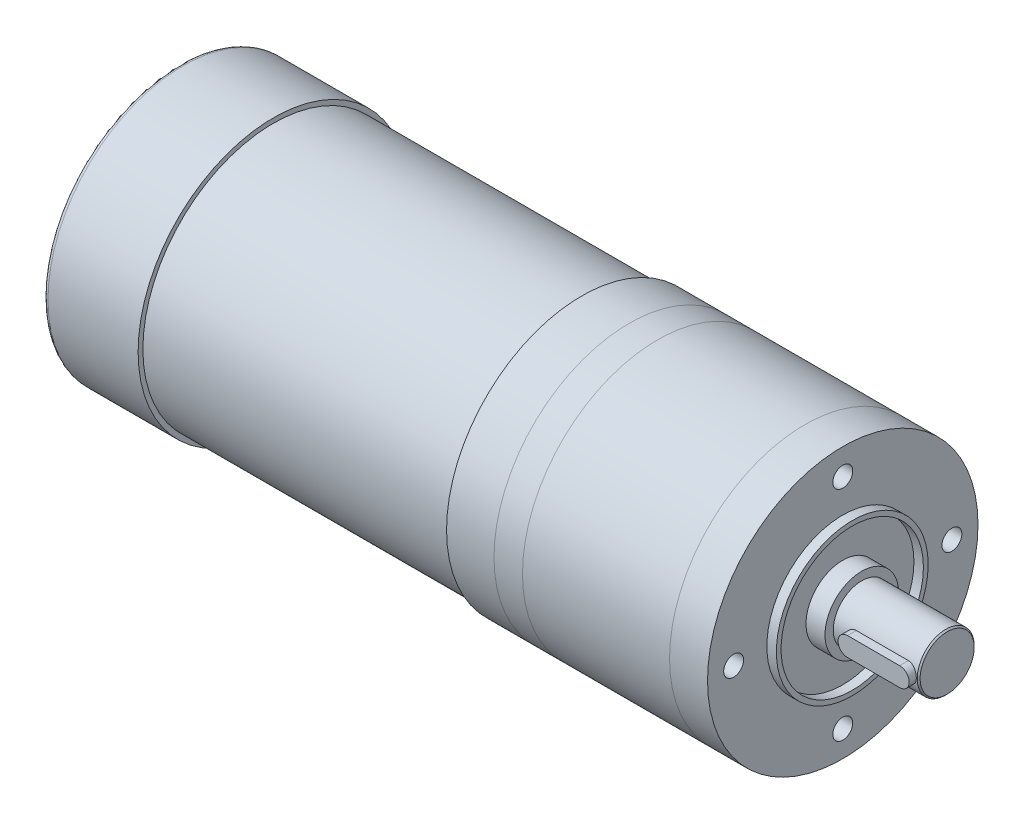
from build123d import *

# Parameters (mm, degrees)
SKETCH_1_R                  = 28.5
EXTRUDE_1_DEPTH             = 8
SKETCH_2_R                  = 28.5
EXTRUDE_2_DEPTH             = 31
SKETCH_3_R                  = 28.5
EXTRUDE_3_DEPTH             = 6
SKETCH_4_R                  = 28.5
EXTRUDE_4_DEPTH             = 10
SKETCH_5_R                  = 27.5
EXTRUDE_5_DEPTH             = 65
SKETCH_6_R                  = 28.5
EXTRUDE_6_DEPTH             = 20
FILLET_1_R                  = 1
SKETCH_7_R                  = 16
SKETCH_7_R_2                = 15
EXTRUDE_7_DEPTH             = 2
SKETCH_8_R                  = 7.75
EXTRUDE_8_DEPTH             = 4
SKETCH_9_R                  = 6
EXTRUDE_9_DEPTH             = 18
HOLE_WIZARD_M5_1_AT_2_COUNT = 2
HOLE_WIZARD_M5_1_AT_2_PITCH = 32.526911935
HOLE_WIZARD_M5_1_AT_3_COUNT = 2
HOLE_WIZARD_M5_1_AT_3_PITCH = 46
HOLE_WIZARD_M5_1_AT_4_COUNT = 2
HOLE_WIZARD_M5_1_AT_4_PITCH = 32.526911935
CUT_EXTRUDE_1_DEPTH         = 2.5
EXTRUDE_10_DEPTH            = 4
CHAMFER_1_SIZE              = 0.3


with BuildPart() as part:
    # Sketch 1 → Extrude 1 (new body)
    with BuildSketch(Plane(origin=(0, 0, 0), x_dir=(0, 0, -1), z_dir=(1, 0, 0))):
        Circle(SKETCH_1_R)
    extrude(amount=-EXTRUDE_1_DEPTH)

    # Sketch 7 → Extrude 7 (add)
    with BuildSketch(Plane(origin=(0, 0, 0), x_dir=(0, 0, -1), z_dir=(1, 0, 0))):
        Circle(SKETCH_7_R)
        Circle(SKETCH_7_R_2, mode=Mode.SUBTRACT)
    extrude(amount=EXTRUDE_7_DEPTH)

    # Sketch 8 → Extrude 8 (add)
    with BuildSketch(Plane(origin=(0, 0, 0), x_dir=(0, 0, -1), z_dir=(1, 0, 0))):
        Circle(SKETCH_8_R)
    extrude(amount=EXTRUDE_8_DEPTH)

    # Sketch 9 → Extrude 9 (add)
    with BuildSketch(Plane(origin=(4, 0, 0), x_dir=(0, 0, -1), z_dir=(1, 0, 0))):
        Circle(SKETCH_9_R)
    extrude(amount=EXTRUDE_9_DEPTH)


with BuildPart() as body_2:
    # Sketch 2 → Extrude 2 (new body)
    with BuildSketch(Plane.ZY.offset(8)):
        Circle(SKETCH_2_R)
    extrude(amount=EXTRUDE_2_DEPTH)


with BuildPart() as body_3:
    # Sketch 3 → Extrude 3 (new body)
    with BuildSketch(Plane.ZY.offset(39)):
        Circle(SKETCH_3_R)
    extrude(amount=EXTRUDE_3_DEPTH)


with BuildPart() as body_4:
    # Sketch 4 → Extrude 4 (new body)
    with BuildSketch(Plane.ZY.offset(45)):
        Circle(SKETCH_4_R)
    extrude(amount=EXTRUDE_4_DEPTH)

    # Sketch 5 → Extrude 5 (add)
    with BuildSketch(Plane.ZY.offset(55)):
        Circle(SKETCH_5_R)
    extrude(amount=EXTRUDE_5_DEPTH)

    # Sketch 6 → Extrude 6 (add)
    with BuildSketch(Plane.ZY.offset(120)):
        Circle(SKETCH_6_R)
    extrude(amount=EXTRUDE_6_DEPTH)

    # Fillet 1
    fillet_1_edges = [body_4.edges().sort_by_distance(p)[0] for p in [
        (-140, 0, -28.5),
    ]]
    fillet(fillet_1_edges, radius=FILLET_1_R)


with BuildPart() as hole_wizard_m5_1_tool:
    # Sketch 11 → Hole Wizard M5 _1 (revolve)
    with BuildSketch(Plane(origin=(0, 23, 0), x_dir=(0, 0, -1), z_dir=(0, 1, 0))):
        Polygon((0, 0), (0, 15.2618073), (2.1, 14), (2.1, 0), align=None)
    hole_wizard_m5_1 = revolve(axis=Axis((6.35, 23, 0), (-1, 0, 0)))


with BuildPart() as part_1:
    add(part.part)

    # Hole Wizard M5 _1: cut by hole_wizard_m5_1_tool
    add(hole_wizard_m5_1_tool.part, mode=Mode.SUBTRACT)


with BuildPart() as body_2_1:
    add(body_2.part)

    # Hole Wizard M5 _1: cut by hole_wizard_m5_1_tool
    add(hole_wizard_m5_1_tool.part, mode=Mode.SUBTRACT)


with BuildPart() as hole_wizard_m5_1_at_2_tool:
    # Hole Wizard M5 _1 at 2: Hole Wizard M5 _1 ×2
    with Locations(*[Vector(0, -0.7071067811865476, -0.7071067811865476) * (i * HOLE_WIZARD_M5_1_AT_2_PITCH) for i in range(1, HOLE_WIZARD_M5_1_AT_2_COUNT)]):
        add(hole_wizard_m5_1)


with BuildPart() as part_2:
    add(part_1.part)

    # Hole Wizard M5 _1 at 2: cut by hole_wizard_m5_1_at_2_tool
    add(hole_wizard_m5_1_at_2_tool.part, mode=Mode.SUBTRACT)


with BuildPart() as body_2_2:
    add(body_2_1.part)

    # Hole Wizard M5 _1 at 2: cut by hole_wizard_m5_1_at_2_tool
    add(hole_wizard_m5_1_at_2_tool.part, mode=Mode.SUBTRACT)


with BuildPart() as hole_wizard_m5_1_at_3_tool:
    # Hole Wizard M5 _1 at 3: Hole Wizard M5 _1 ×2
    with Locations(*[(0, -i * HOLE_WIZARD_M5_1_AT_3_PITCH, 0) for i in range(1, HOLE_WIZARD_M5_1_AT_3_COUNT)]):
        add(hole_wizard_m5_1)


with BuildPart() as part_3:
    add(part_2.part)

    # Hole Wizard M5 _1 at 3: cut by hole_wizard_m5_1_at_3_tool
    add(hole_wizard_m5_1_at_3_tool.part, mode=Mode.SUBTRACT)


with BuildPart() as body_2_3:
    add(body_2_2.part)

    # Hole Wizard M5 _1 at 3: cut by hole_wizard_m5_1_at_3_tool
    add(hole_wizard_m5_1_at_3_tool.part, mode=Mode.SUBTRACT)


with BuildPart() as hole_wizard_m5_1_at_4_tool:
    # Hole Wizard M5 _1 at 4: Hole Wizard M5 _1 ×2
    with Locations(*[Vector(0, -0.7071067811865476, 0.7071067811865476) * (i * HOLE_WIZARD_M5_1_AT_4_PITCH) for i in range(1, HOLE_WIZARD_M5_1_AT_4_COUNT)]):
        add(hole_wizard_m5_1)


with BuildPart() as part_4:
    add(part_3.part)

    # Hole Wizard M5 _1 at 4: cut by hole_wizard_m5_1_at_4_tool
    add(hole_wizard_m5_1_at_4_tool.part, mode=Mode.SUBTRACT)

    # Sketch 12 → Cut-Extrude 1 (cut)
    with BuildSketch(Plane.XY.offset(6)):
        with BuildLine():
            Line((8.5, 2), (19.5, 2))
            ThreePointArc((19.5, 2), (21.5, 0), (19.5, -2))
            Line((19.5, -2), (8.5, -2))
            ThreePointArc((8.5, -2), (6.5, 0), (8.5, 2))
        make_face()
    extrude(amount=-CUT_EXTRUDE_1_DEPTH, mode=Mode.SUBTRACT)

    # Chamfer 1
    chamfer_1_edges = [part_4.edges().sort_by_distance(p)[0] for p in [
        (22, 0, 6),
    ]]
    chamfer(chamfer_1_edges, length=CHAMFER_1_SIZE)


with BuildPart() as body_2_4:
    add(body_2_3.part)

    # Hole Wizard M5 _1 at 4: cut by hole_wizard_m5_1_at_4_tool
    add(hole_wizard_m5_1_at_4_tool.part, mode=Mode.SUBTRACT)


with BuildPart() as body_5:
    # Sketch 13 → Extrude 10 (new body)
    with BuildSketch(Plane.XY.offset(3.5)):
        with BuildLine():
            Line((8.5, 2), (19.5, 2))
            ThreePointArc((19.5, 2), (21.5, 0), (19.5, -2))
            Line((19.5, -2), (8.5, -2))
            ThreePointArc((8.5, -2), (6.5, 0), (8.5, 2))
        make_face()
    extrude(amount=EXTRUDE_10_DEPTH)


solid = Compound([body_3.part, body_4.part, part_4.part, body_2_4.part, body_5.part])
